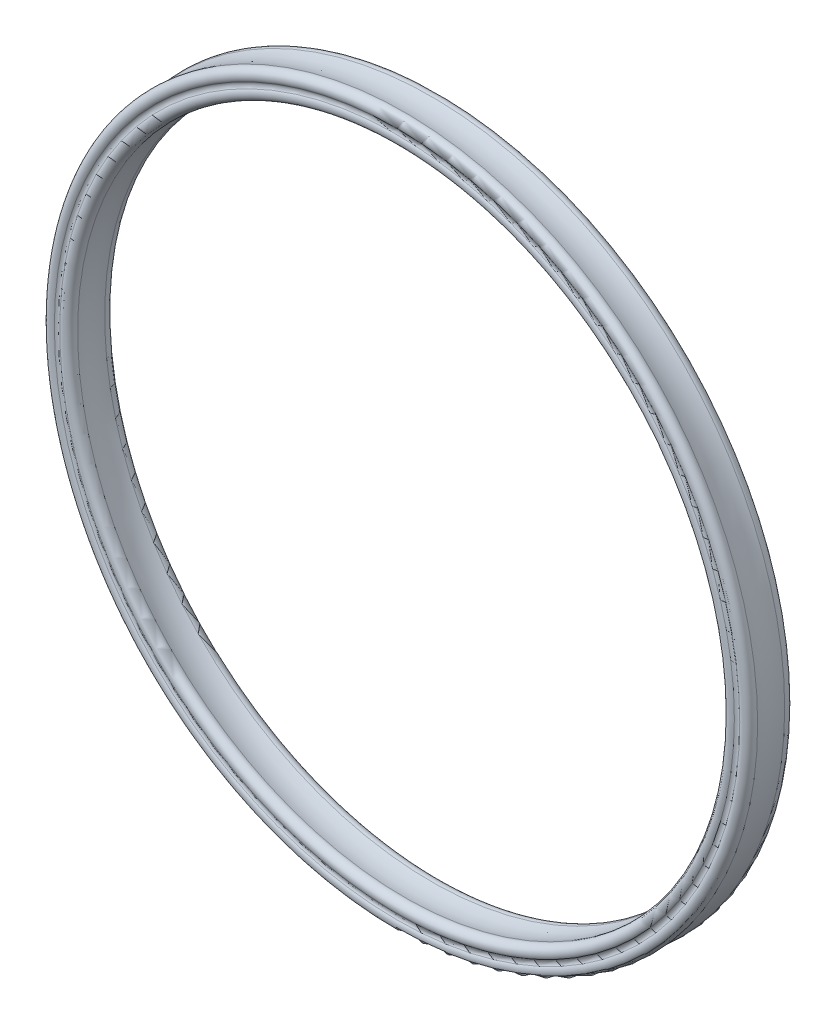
from build123d import *


with BuildPart() as part:
    # Esquisse1 → Base-R_volution (revolve)
    with BuildSketch(Plane(origin=(0, 0, 0), x_dir=(0, 0, -1), z_dir=(1, 0, 0)), mode=Mode.PRIVATE) as base_r_volution_sk:
        with BuildLine():
            ThreePointArc((0.94479638, 38.015879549), (0.133951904, 37.744865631), (0.145, 36.89))
            ThreePointArc((0.145, 36.89), (0.241666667, 36.6), (0.145, 36.31))
            ThreePointArc((0.145, 36.31), (0.133951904, 35.455134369), (0.94479638, 35.184120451))
            ThreePointArc((0.94479638, 35.184120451), (2.4, 35.410021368), (3.85520362, 35.184120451))
            ThreePointArc((3.85520362, 35.184120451), (4.666048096, 35.455134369), (4.655, 36.31))
            ThreePointArc((4.655, 36.31), (4.558333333, 36.6), (4.655, 36.89))
            ThreePointArc((4.655, 36.89), (4.666048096, 37.744865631), (3.85520362, 38.015879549))
            ThreePointArc((3.85520362, 38.015879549), (2.4, 37.789978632), (0.94479638, 38.015879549))
        make_face()
    revolve(base_r_volution_sk.sketch.rotate(Axis((0, 0, 0), (0, 0, -1)), 90), axis=Axis((0, 0, 0), (0, 0, -1)))


solid = part.part
